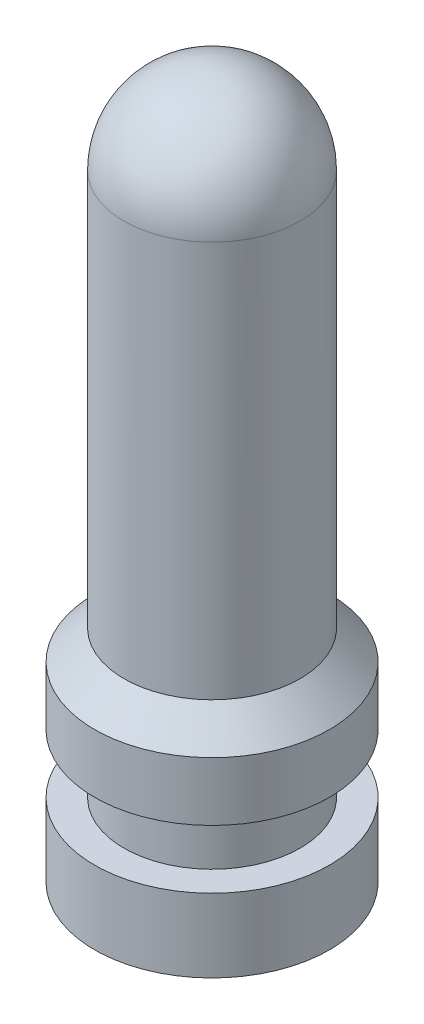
ISO-10303-21;
HEADER;
FILE_DESCRIPTION(('STEP AP214'),'2;1');
FILE_NAME('part.step','',(''),(''),'','','');
FILE_SCHEMA(('AUTOMOTIVE_DESIGN { 1 0 10303 214 1 1 1 1 }'));
ENDSEC;
DATA;
#1=APPLICATION_CONTEXT('core data for automotive mechanical design processes');
#2=APPLICATION_PROTOCOL_DEFINITION('international standard','automotive_design',2000,#1);
#3=PRODUCT_CONTEXT('',#1,'mechanical');
#4=PRODUCT('Part','Part','',(#3));
#5=PRODUCT_RELATED_PRODUCT_CATEGORY('part','',(#4));
#6=PRODUCT_DEFINITION_FORMATION('','',#4);
#7=PRODUCT_DEFINITION_CONTEXT('part definition',#1,'design');
#8=PRODUCT_DEFINITION('design','',#6,#7);
#9=PRODUCT_DEFINITION_SHAPE('','',#8);
#10=(LENGTH_UNIT() NAMED_UNIT(*) SI_UNIT(.MILLI.,.METRE.));
#11=(NAMED_UNIT(*) PLANE_ANGLE_UNIT() SI_UNIT($,.RADIAN.));
#12=(NAMED_UNIT(*) SI_UNIT($,.STERADIAN.) SOLID_ANGLE_UNIT());
#13=UNCERTAINTY_MEASURE_WITH_UNIT(LENGTH_MEASURE(1.E-05),#10,'distance_accuracy_value','');
#14=(GEOMETRIC_REPRESENTATION_CONTEXT(3) GLOBAL_UNCERTAINTY_ASSIGNED_CONTEXT((#13)) GLOBAL_UNIT_ASSIGNED_CONTEXT((#10,
#11,#12)) REPRESENTATION_CONTEXT('',''));
#15=CARTESIAN_POINT('',(0.,0.,0.));
#16=DIRECTION('',(0.,0.,1.));
#17=DIRECTION('',(1.,0.,0.));
#18=AXIS2_PLACEMENT_3D('',#15,#16,#17);
#19=CARTESIAN_POINT('',(0.,21.,0.));
#20=DIRECTION('',(0.,-1.,0.));
#21=DIRECTION('',(1.,0.,0.));
#22=AXIS2_PLACEMENT_3D('',#19,#20,#21);
#23=SPHERICAL_SURFACE('',#22,3.);
#24=CARTESIAN_POINT('',(0.,21.,0.));
#25=DIRECTION('',(0.,-1.,0.));
#26=DIRECTION('',(0.,0.,-1.));
#27=AXIS2_PLACEMENT_3D('',#24,#25,#26);
#28=CIRCLE('',#27,3.);
#29=CARTESIAN_POINT('',(0.,21.,-3.00000000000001));
#30=VERTEX_POINT('',#29);
#31=EDGE_CURVE('E10',#30,#30,#28,.T.);
#32=ORIENTED_EDGE('',*,*,#31,.F.);
#33=EDGE_LOOP('',(#32));
#34=FACE_BOUND('',#33,.T.);
#35=ADVANCED_FACE('F20',(#34),#23,.T.);
#36=CARTESIAN_POINT('',(0.,0.,0.));
#37=DIRECTION('',(0.,-1.,0.));
#38=DIRECTION('',(0.,0.,-1.));
#39=AXIS2_PLACEMENT_3D('',#36,#37,#38);
#40=CYLINDRICAL_SURFACE('',#39,3.);
#41=ORIENTED_EDGE('',*,*,#31,.T.);
#42=EDGE_LOOP('',(#41));
#43=FACE_BOUND('',#42,.T.);
#44=CARTESIAN_POINT('',(0.,7.50000000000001,0.));
#45=DIRECTION('',(0.,-1.,0.));
#46=DIRECTION('',(0.,0.,-1.));
#47=AXIS2_PLACEMENT_3D('',#44,#45,#46);
#48=CIRCLE('',#47,3.);
#49=CARTESIAN_POINT('',(0.,7.50000000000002,-3.));
#50=VERTEX_POINT('',#49);
#51=EDGE_CURVE('E26',#50,#50,#48,.T.);
#52=ORIENTED_EDGE('',*,*,#51,.F.);
#53=EDGE_LOOP('',(#52));
#54=FACE_BOUND('',#53,.T.);
#55=ADVANCED_FACE('F74',(#43,#54),#40,.T.);
#56=CARTESIAN_POINT('',(0.,6.49999999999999,0.));
#57=DIRECTION('',(0.,-1.,0.));
#58=DIRECTION('',(0.,0.,-1.));
#59=AXIS2_PLACEMENT_3D('',#56,#57,#58);
#60=CONICAL_SURFACE('',#59,4.,0.785398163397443);
#61=ORIENTED_EDGE('',*,*,#51,.T.);
#62=EDGE_LOOP('',(#61));
#63=FACE_BOUND('',#62,.T.);
#64=CARTESIAN_POINT('',(0.,6.49999999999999,0.));
#65=DIRECTION('',(0.,-1.,0.));
#66=DIRECTION('',(0.,0.,-1.));
#67=AXIS2_PLACEMENT_3D('',#64,#65,#66);
#68=CIRCLE('',#67,4.);
#69=CARTESIAN_POINT('',(0.,6.49999999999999,-4.));
#70=VERTEX_POINT('',#69);
#71=EDGE_CURVE('E30',#70,#70,#68,.T.);
#72=ORIENTED_EDGE('',*,*,#71,.F.);
#73=EDGE_LOOP('',(#72));
#74=FACE_BOUND('',#73,.T.);
#75=ADVANCED_FACE('F79',(#63,#74),#60,.T.);
#76=CARTESIAN_POINT('',(0.,0.,0.));
#77=DIRECTION('',(0.,-1.,0.));
#78=DIRECTION('',(0.,0.,-1.));
#79=AXIS2_PLACEMENT_3D('',#76,#77,#78);
#80=CYLINDRICAL_SURFACE('',#79,4.);
#81=ORIENTED_EDGE('',*,*,#71,.T.);
#82=EDGE_LOOP('',(#81));
#83=FACE_BOUND('',#82,.T.);
#84=CARTESIAN_POINT('',(0.,4.49999999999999,0.));
#85=DIRECTION('',(0.,-1.,0.));
#86=DIRECTION('',(0.,0.,-1.));
#87=AXIS2_PLACEMENT_3D('',#84,#85,#86);
#88=CIRCLE('',#87,4.);
#89=CARTESIAN_POINT('',(0.,4.49999999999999,-4.));
#90=VERTEX_POINT('',#89);
#91=EDGE_CURVE('E34',#90,#90,#88,.T.);
#92=ORIENTED_EDGE('',*,*,#91,.F.);
#93=EDGE_LOOP('',(#92));
#94=FACE_BOUND('',#93,.T.);
#95=ADVANCED_FACE('F83',(#83,#94),#80,.T.);
#96=CARTESIAN_POINT('',(4.,4.5,0.));
#97=DIRECTION('',(0.,-1.,0.));
#98=DIRECTION('',(0.,0.,-1.));
#99=AXIS2_PLACEMENT_3D('',#96,#97,#98);
#100=PLANE('',#99);
#101=ORIENTED_EDGE('',*,*,#91,.T.);
#102=EDGE_LOOP('',(#101));
#103=FACE_BOUND('',#102,.T.);
#104=CARTESIAN_POINT('',(0.,4.49999999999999,0.));
#105=DIRECTION('',(0.,-1.,0.));
#106=DIRECTION('',(0.,0.,-1.));
#107=AXIS2_PLACEMENT_3D('',#104,#105,#106);
#108=CIRCLE('',#107,3.);
#109=CARTESIAN_POINT('',(0.,4.49999999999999,-3.));
#110=VERTEX_POINT('',#109);
#111=EDGE_CURVE('E39',#110,#110,#108,.T.);
#112=ORIENTED_EDGE('',*,*,#111,.F.);
#113=EDGE_LOOP('',(#112));
#114=FACE_BOUND('',#113,.T.);
#115=ADVANCED_FACE('F89',(#103,#114),#100,.T.);
#116=CARTESIAN_POINT('',(0.,0.,0.));
#117=DIRECTION('',(0.,-1.,0.));
#118=DIRECTION('',(0.,0.,-1.));
#119=AXIS2_PLACEMENT_3D('',#116,#117,#118);
#120=CYLINDRICAL_SURFACE('',#119,3.);
#121=ORIENTED_EDGE('',*,*,#111,.T.);
#122=EDGE_LOOP('',(#121));
#123=FACE_BOUND('',#122,.T.);
#124=CARTESIAN_POINT('',(0.,2.5,0.));
#125=DIRECTION('',(0.,-1.,0.));
#126=DIRECTION('',(0.,0.,-1.));
#127=AXIS2_PLACEMENT_3D('',#124,#125,#126);
#128=CIRCLE('',#127,3.);
#129=CARTESIAN_POINT('',(0.,2.5,-3.));
#130=VERTEX_POINT('',#129);
#131=EDGE_CURVE('E42',#130,#130,#128,.T.);
#132=ORIENTED_EDGE('',*,*,#131,.F.);
#133=EDGE_LOOP('',(#132));
#134=FACE_BOUND('',#133,.T.);
#135=ADVANCED_FACE('F93',(#123,#134),#120,.T.);
#136=CARTESIAN_POINT('',(3.,2.5,0.));
#137=DIRECTION('',(0.,1.,0.));
#138=DIRECTION('',(0.,0.,1.));
#139=AXIS2_PLACEMENT_3D('',#136,#137,#138);
#140=PLANE('',#139);
#141=ORIENTED_EDGE('',*,*,#131,.T.);
#142=EDGE_LOOP('',(#141));
#143=FACE_BOUND('',#142,.T.);
#144=CARTESIAN_POINT('',(0.,2.5,0.));
#145=DIRECTION('',(0.,-1.,0.));
#146=DIRECTION('',(0.,0.,-1.));
#147=AXIS2_PLACEMENT_3D('',#144,#145,#146);
#148=CIRCLE('',#147,4.);
#149=CARTESIAN_POINT('',(0.,2.5,-4.));
#150=VERTEX_POINT('',#149);
#151=EDGE_CURVE('E45',#150,#150,#148,.T.);
#152=ORIENTED_EDGE('',*,*,#151,.F.);
#153=EDGE_LOOP('',(#152));
#154=FACE_BOUND('',#153,.T.);
#155=ADVANCED_FACE('F97',(#143,#154),#140,.T.);
#156=CARTESIAN_POINT('',(0.,0.,0.));
#157=DIRECTION('',(0.,-1.,0.));
#158=DIRECTION('',(0.,0.,-1.));
#159=AXIS2_PLACEMENT_3D('',#156,#157,#158);
#160=CYLINDRICAL_SURFACE('',#159,4.);
#161=ORIENTED_EDGE('',*,*,#151,.T.);
#162=EDGE_LOOP('',(#161));
#163=FACE_BOUND('',#162,.T.);
#164=CARTESIAN_POINT('',(0.,0.,0.));
#165=DIRECTION('',(0.,-1.,0.));
#166=DIRECTION('',(0.,0.,-1.));
#167=AXIS2_PLACEMENT_3D('',#164,#165,#166);
#168=CIRCLE('',#167,4.);
#169=CARTESIAN_POINT('',(0.,0.,-4.));
#170=VERTEX_POINT('',#169);
#171=EDGE_CURVE('E48',#170,#170,#168,.T.);
#172=ORIENTED_EDGE('',*,*,#171,.F.);
#173=EDGE_LOOP('',(#172));
#174=FACE_BOUND('',#173,.T.);
#175=ADVANCED_FACE('F70',(#163,#174),#160,.T.);
#176=CARTESIAN_POINT('',(3.5,0.,0.));
#177=DIRECTION('',(0.,-1.,0.));
#178=DIRECTION('',(0.,0.,-1.));
#179=AXIS2_PLACEMENT_3D('',#176,#177,#178);
#180=PLANE('',#179);
#181=ORIENTED_EDGE('',*,*,#171,.T.);
#182=EDGE_LOOP('',(#181));
#183=FACE_BOUND('',#182,.T.);
#184=CARTESIAN_POINT('',(0.,0.,0.));
#185=DIRECTION('',(0.,-1.,0.));
#186=DIRECTION('',(0.,0.,-1.));
#187=AXIS2_PLACEMENT_3D('',#184,#185,#186);
#188=CIRCLE('',#187,3.5);
#189=CARTESIAN_POINT('',(0.,0.,-3.5));
#190=VERTEX_POINT('',#189);
#191=EDGE_CURVE('E51',#190,#190,#188,.T.);
#192=ORIENTED_EDGE('',*,*,#191,.F.);
#193=EDGE_LOOP('',(#192));
#194=FACE_BOUND('',#193,.T.);
#195=ADVANCED_FACE('F62',(#183,#194),#180,.T.);
#196=CARTESIAN_POINT('',(0.,0.,0.));
#197=DIRECTION('',(0.,-1.,0.));
#198=DIRECTION('',(0.,0.,-1.));
#199=AXIS2_PLACEMENT_3D('',#196,#197,#198);
#200=DEGENERATE_TOROIDAL_SURFACE('',#199,0.750678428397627,2.74932157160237,.T.);
#201=ORIENTED_EDGE('',*,*,#191,.T.);
#202=EDGE_LOOP('',(#201));
#203=FACE_BOUND('',#202,.T.);
#204=CARTESIAN_POINT('',(0.,2.22659529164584,0.));
#205=DIRECTION('',(0.,-1.,0.));
#206=DIRECTION('',(0.,0.,-1.));
#207=AXIS2_PLACEMENT_3D('',#204,#205,#206);
#208=CIRCLE('',#207,2.36345321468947);
#209=CARTESIAN_POINT('',(0.,2.22659529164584,-2.36345321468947));
#210=VERTEX_POINT('',#209);
#211=EDGE_CURVE('E54',#210,#210,#208,.T.);
#212=ORIENTED_EDGE('',*,*,#211,.F.);
#213=EDGE_LOOP('',(#212));
#214=FACE_BOUND('',#213,.T.);
#215=ADVANCED_FACE('F60',(#203,#214),#200,.F.);
#216=CARTESIAN_POINT('',(0.,0.670000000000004,0.));
#217=DIRECTION('',(0.,-1.,0.));
#218=DIRECTION('',(1.,0.,0.));
#219=AXIS2_PLACEMENT_3D('',#216,#217,#218);
#220=SPHERICAL_SURFACE('',#219,2.83);
#221=ORIENTED_EDGE('',*,*,#211,.T.);
#222=EDGE_LOOP('',(#221));
#223=FACE_BOUND('',#222,.T.);
#224=ADVANCED_FACE('F58',(#223),#220,.F.);
#225=CLOSED_SHELL('',(#35,#55,#75,#95,#115,#135,#155,#175,#195,#215,#224));
#226=MANIFOLD_SOLID_BREP('B2',#225);
#227=ADVANCED_BREP_SHAPE_REPRESENTATION('',(#18,#226),#14);
#228=SHAPE_DEFINITION_REPRESENTATION(#9,#227);
ENDSEC;
END-ISO-10303-21;
